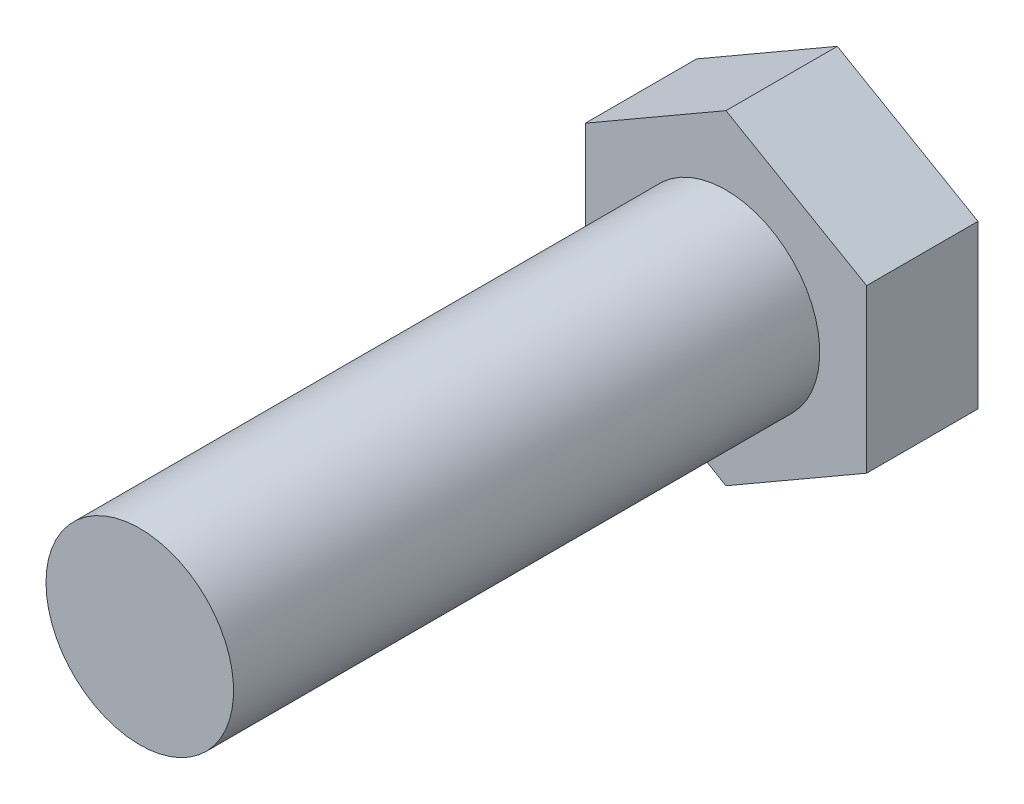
ISO-10303-21;
HEADER;
FILE_DESCRIPTION(('STEP AP214'),'2;1');
FILE_NAME('part.step','',(''),(''),'','','');
FILE_SCHEMA(('AUTOMOTIVE_DESIGN { 1 0 10303 214 1 1 1 1 }'));
ENDSEC;
DATA;
#1=APPLICATION_CONTEXT('core data for automotive mechanical design processes');
#2=APPLICATION_PROTOCOL_DEFINITION('international standard','automotive_design',2000,#1);
#3=PRODUCT_CONTEXT('',#1,'mechanical');
#4=PRODUCT('Part','Part','',(#3));
#5=PRODUCT_RELATED_PRODUCT_CATEGORY('part','',(#4));
#6=PRODUCT_DEFINITION_FORMATION('','',#4);
#7=PRODUCT_DEFINITION_CONTEXT('part definition',#1,'design');
#8=PRODUCT_DEFINITION('design','',#6,#7);
#9=PRODUCT_DEFINITION_SHAPE('','',#8);
#10=(LENGTH_UNIT() NAMED_UNIT(*) SI_UNIT(.MILLI.,.METRE.));
#11=(NAMED_UNIT(*) PLANE_ANGLE_UNIT() SI_UNIT($,.RADIAN.));
#12=(NAMED_UNIT(*) SI_UNIT($,.STERADIAN.) SOLID_ANGLE_UNIT());
#13=UNCERTAINTY_MEASURE_WITH_UNIT(LENGTH_MEASURE(1.E-05),#10,'distance_accuracy_value','');
#14=(GEOMETRIC_REPRESENTATION_CONTEXT(3) GLOBAL_UNCERTAINTY_ASSIGNED_CONTEXT((#13)) GLOBAL_UNIT_ASSIGNED_CONTEXT((#10,
#11,#12)) REPRESENTATION_CONTEXT('',''));
#15=CARTESIAN_POINT('',(0.,0.,0.));
#16=DIRECTION('',(0.,0.,1.));
#17=DIRECTION('',(1.,0.,0.));
#18=AXIS2_PLACEMENT_3D('',#15,#16,#17);
#19=CARTESIAN_POINT('',(0.,0.,61.));
#20=DIRECTION('',(0.,0.,-1.));
#21=DIRECTION('',(-1.,0.,0.));
#22=AXIS2_PLACEMENT_3D('',#19,#20,#21);
#23=PLANE('',#22);
#24=CARTESIAN_POINT('',(0.,0.,61.));
#25=DIRECTION('',(0.,0.,-1.));
#26=DIRECTION('',(-1.,0.,0.));
#27=AXIS2_PLACEMENT_3D('',#24,#25,#26);
#28=CIRCLE('',#27,8.);
#29=CARTESIAN_POINT('',(-8.,0.,61.));
#30=VERTEX_POINT('',#29);
#31=EDGE_CURVE('E22',#30,#30,#28,.T.);
#32=ORIENTED_EDGE('',*,*,#31,.F.);
#33=EDGE_LOOP('',(#32));
#34=FACE_BOUND('',#33,.T.);
#35=ADVANCED_FACE('F15',(#34),#23,.F.);
#36=CARTESIAN_POINT('',(0.,0.,-9.));
#37=DIRECTION('',(0.,0.,-1.));
#38=DIRECTION('',(-1.,0.,0.));
#39=AXIS2_PLACEMENT_3D('',#36,#37,#38);
#40=CYLINDRICAL_SURFACE('',#39,8.);
#41=CARTESIAN_POINT('',(0.,0.,11.));
#42=DIRECTION('',(0.,0.,-1.));
#43=DIRECTION('',(-1.,0.,0.));
#44=AXIS2_PLACEMENT_3D('',#41,#42,#43);
#45=CIRCLE('',#44,8.);
#46=CARTESIAN_POINT('',(-8.,0.,11.));
#47=VERTEX_POINT('',#46);
#48=EDGE_CURVE('E110',#47,#47,#45,.T.);
#49=ORIENTED_EDGE('',*,*,#48,.F.);
#50=EDGE_LOOP('',(#49));
#51=FACE_BOUND('',#50,.T.);
#52=ORIENTED_EDGE('',*,*,#31,.T.);
#53=EDGE_LOOP('',(#52));
#54=FACE_BOUND('',#53,.T.);
#55=ADVANCED_FACE('F154',(#51,#54),#40,.T.);
#56=CARTESIAN_POINT('',(-8.,0.,11.));
#57=DIRECTION('',(0.,0.,-1.));
#58=DIRECTION('',(-1.,0.,0.));
#59=AXIS2_PLACEMENT_3D('',#56,#57,#58);
#60=PLANE('',#59);
#61=DIRECTION('',(0.866025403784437,-0.5,0.));
#62=VECTOR('',#61,1.);
#63=CARTESIAN_POINT('',(0.,13.856406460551,11.));
#64=LINE('',#63,#62);
#65=CARTESIAN_POINT('',(0.,13.8564064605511,11.));
#66=VERTEX_POINT('',#65);
#67=CARTESIAN_POINT('',(12.,6.92820323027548,11.));
#68=VERTEX_POINT('',#67);
#69=EDGE_CURVE('E81',#66,#68,#64,.T.);
#70=ORIENTED_EDGE('',*,*,#69,.F.);
#71=DIRECTION('',(-0.866025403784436,-0.5,0.));
#72=VECTOR('',#71,1.);
#73=CARTESIAN_POINT('',(-12.,6.92820323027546,11.));
#74=LINE('',#73,#72);
#75=CARTESIAN_POINT('',(-12.,6.92820323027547,11.));
#76=VERTEX_POINT('',#75);
#77=EDGE_CURVE('E107',#66,#76,#74,.T.);
#78=ORIENTED_EDGE('',*,*,#77,.T.);
#79=DIRECTION('',(0.,-1.,0.));
#80=VECTOR('',#79,1.);
#81=CARTESIAN_POINT('',(-12.,0.,11.));
#82=LINE('',#81,#80);
#83=CARTESIAN_POINT('',(-12.,-6.92820323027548,11.));
#84=VERTEX_POINT('',#83);
#85=EDGE_CURVE('E104',#76,#84,#82,.T.);
#86=ORIENTED_EDGE('',*,*,#85,.T.);
#87=DIRECTION('',(-0.866025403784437,0.5,0.));
#88=VECTOR('',#87,1.);
#89=CARTESIAN_POINT('',(-12.,-6.92820323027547,11.));
#90=LINE('',#89,#88);
#91=CARTESIAN_POINT('',(0.,-13.8564064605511,11.));
#92=VERTEX_POINT('',#91);
#93=EDGE_CURVE('E102',#92,#84,#90,.T.);
#94=ORIENTED_EDGE('',*,*,#93,.F.);
#95=DIRECTION('',(0.866025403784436,0.5,0.));
#96=VECTOR('',#95,1.);
#97=CARTESIAN_POINT('',(0.,-13.856406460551,11.));
#98=LINE('',#97,#96);
#99=CARTESIAN_POINT('',(12.,-6.92820323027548,11.));
#100=VERTEX_POINT('',#99);
#101=EDGE_CURVE('E99',#92,#100,#98,.T.);
#102=ORIENTED_EDGE('',*,*,#101,.T.);
#103=DIRECTION('',(0.,-1.,0.));
#104=VECTOR('',#103,1.);
#105=CARTESIAN_POINT('',(12.,0.,11.));
#106=LINE('',#105,#104);
#107=EDGE_CURVE('E97',#68,#100,#106,.T.);
#108=ORIENTED_EDGE('',*,*,#107,.F.);
#109=EDGE_LOOP('',(#70,#78,#86,#94,#102,#108));
#110=FACE_BOUND('',#109,.T.);
#111=ORIENTED_EDGE('',*,*,#48,.T.);
#112=EDGE_LOOP('',(#111));
#113=FACE_BOUND('',#112,.T.);
#114=ADVANCED_FACE('F136',(#110,#113),#60,.F.);
#115=CARTESIAN_POINT('',(0.,13.8564064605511,12.));
#116=DIRECTION('',(0.5,-0.866025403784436,0.));
#117=DIRECTION('',(-0.866025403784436,-0.5,0.));
#118=AXIS2_PLACEMENT_3D('',#115,#116,#117);
#119=PLANE('',#118);
#120=DIRECTION('',(0.,0.,-1.));
#121=VECTOR('',#120,1.);
#122=CARTESIAN_POINT('',(0.,13.8564064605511,12.));
#123=LINE('',#122,#121);
#124=CARTESIAN_POINT('',(0.,13.8564064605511,1.5));
#125=VERTEX_POINT('',#124);
#126=EDGE_CURVE('E35',#66,#125,#123,.T.);
#127=ORIENTED_EDGE('',*,*,#126,.T.);
#128=DIRECTION('',(-0.866025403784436,-0.5,0.));
#129=VECTOR('',#128,1.);
#130=CARTESIAN_POINT('',(0.,13.8564064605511,1.5));
#131=LINE('',#130,#129);
#132=CARTESIAN_POINT('',(-12.,6.92820323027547,1.5));
#133=VERTEX_POINT('',#132);
#134=EDGE_CURVE('E28',#125,#133,#131,.T.);
#135=ORIENTED_EDGE('',*,*,#134,.T.);
#136=DIRECTION('',(0.,0.,-1.));
#137=VECTOR('',#136,1.);
#138=CARTESIAN_POINT('',(-12.,6.92820323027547,12.));
#139=LINE('',#138,#137);
#140=EDGE_CURVE('E93',#76,#133,#139,.T.);
#141=ORIENTED_EDGE('',*,*,#140,.F.);
#142=ORIENTED_EDGE('',*,*,#77,.F.);
#143=EDGE_LOOP('',(#127,#135,#141,#142));
#144=FACE_BOUND('',#143,.T.);
#145=ADVANCED_FACE('F130',(#144),#119,.F.);
#146=CARTESIAN_POINT('',(-12.,6.92820323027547,12.));
#147=DIRECTION('',(1.,0.,0.));
#148=DIRECTION('',(0.,0.,-1.));
#149=AXIS2_PLACEMENT_3D('',#146,#147,#148);
#150=PLANE('',#149);
#151=ORIENTED_EDGE('',*,*,#140,.T.);
#152=DIRECTION('',(0.,-1.,0.));
#153=VECTOR('',#152,1.);
#154=CARTESIAN_POINT('',(-12.,6.92820323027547,1.5));
#155=LINE('',#154,#153);
#156=CARTESIAN_POINT('',(-12.,-6.92820323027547,1.5));
#157=VERTEX_POINT('',#156);
#158=EDGE_CURVE('E126',#133,#157,#155,.T.);
#159=ORIENTED_EDGE('',*,*,#158,.T.);
#160=DIRECTION('',(0.,0.,-1.));
#161=VECTOR('',#160,1.);
#162=CARTESIAN_POINT('',(-12.,-6.92820323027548,12.));
#163=LINE('',#162,#161);
#164=EDGE_CURVE('E90',#84,#157,#163,.T.);
#165=ORIENTED_EDGE('',*,*,#164,.F.);
#166=ORIENTED_EDGE('',*,*,#85,.F.);
#167=EDGE_LOOP('',(#151,#159,#165,#166));
#168=FACE_BOUND('',#167,.T.);
#169=ADVANCED_FACE('F132',(#168),#150,.F.);
#170=CARTESIAN_POINT('',(0.,-13.8564064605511,12.));
#171=DIRECTION('',(-0.5,-0.866025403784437,0.));
#172=DIRECTION('',(-0.866025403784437,0.5,0.));
#173=AXIS2_PLACEMENT_3D('',#170,#171,#172);
#174=PLANE('',#173);
#175=DIRECTION('',(-0.866025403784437,0.5,0.));
#176=VECTOR('',#175,1.);
#177=CARTESIAN_POINT('',(0.,-13.8564064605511,1.5));
#178=LINE('',#177,#176);
#179=CARTESIAN_POINT('',(0.,-13.8564064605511,1.5));
#180=VERTEX_POINT('',#179);
#181=EDGE_CURVE('E124',#180,#157,#178,.T.);
#182=ORIENTED_EDGE('',*,*,#181,.F.);
#183=DIRECTION('',(0.,0.,-1.));
#184=VECTOR('',#183,1.);
#185=CARTESIAN_POINT('',(0.,-13.8564064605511,12.));
#186=LINE('',#185,#184);
#187=EDGE_CURVE('E83',#92,#180,#186,.T.);
#188=ORIENTED_EDGE('',*,*,#187,.F.);
#189=ORIENTED_EDGE('',*,*,#93,.T.);
#190=ORIENTED_EDGE('',*,*,#164,.T.);
#191=EDGE_LOOP('',(#182,#188,#189,#190));
#192=FACE_BOUND('',#191,.T.);
#193=ADVANCED_FACE('F143',(#192),#174,.T.);
#194=CARTESIAN_POINT('',(0.,-13.8564064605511,12.));
#195=DIRECTION('',(-0.5,0.866025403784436,0.));
#196=DIRECTION('',(0.866025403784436,0.5,0.));
#197=AXIS2_PLACEMENT_3D('',#194,#195,#196);
#198=PLANE('',#197);
#199=ORIENTED_EDGE('',*,*,#187,.T.);
#200=DIRECTION('',(0.866025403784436,0.5,0.));
#201=VECTOR('',#200,1.);
#202=CARTESIAN_POINT('',(0.,-13.8564064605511,1.5));
#203=LINE('',#202,#201);
#204=CARTESIAN_POINT('',(12.,-6.92820323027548,1.5));
#205=VERTEX_POINT('',#204);
#206=EDGE_CURVE('E76',#180,#205,#203,.T.);
#207=ORIENTED_EDGE('',*,*,#206,.T.);
#208=DIRECTION('',(0.,0.,-1.));
#209=VECTOR('',#208,1.);
#210=CARTESIAN_POINT('',(12.,-6.92820323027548,12.));
#211=LINE('',#210,#209);
#212=EDGE_CURVE('E75',#100,#205,#211,.T.);
#213=ORIENTED_EDGE('',*,*,#212,.F.);
#214=ORIENTED_EDGE('',*,*,#101,.F.);
#215=EDGE_LOOP('',(#199,#207,#213,#214));
#216=FACE_BOUND('',#215,.T.);
#217=ADVANCED_FACE('F139',(#216),#198,.F.);
#218=CARTESIAN_POINT('',(12.,6.92820323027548,12.));
#219=DIRECTION('',(1.,0.,0.));
#220=DIRECTION('',(0.,0.,-1.));
#221=AXIS2_PLACEMENT_3D('',#218,#219,#220);
#222=PLANE('',#221);
#223=DIRECTION('',(0.,-1.,0.));
#224=VECTOR('',#223,1.);
#225=CARTESIAN_POINT('',(12.,6.92820323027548,1.5));
#226=LINE('',#225,#224);
#227=CARTESIAN_POINT('',(12.,6.92820323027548,1.5));
#228=VERTEX_POINT('',#227);
#229=EDGE_CURVE('E65',#228,#205,#226,.T.);
#230=ORIENTED_EDGE('',*,*,#229,.F.);
#231=DIRECTION('',(0.,0.,-1.));
#232=VECTOR('',#231,1.);
#233=CARTESIAN_POINT('',(12.,6.92820323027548,12.));
#234=LINE('',#233,#232);
#235=EDGE_CURVE('E72',#68,#228,#234,.T.);
#236=ORIENTED_EDGE('',*,*,#235,.F.);
#237=ORIENTED_EDGE('',*,*,#107,.T.);
#238=ORIENTED_EDGE('',*,*,#212,.T.);
#239=EDGE_LOOP('',(#230,#236,#237,#238));
#240=FACE_BOUND('',#239,.T.);
#241=ADVANCED_FACE('F71',(#240),#222,.T.);
#242=CARTESIAN_POINT('',(0.,13.8564064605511,12.));
#243=DIRECTION('',(0.5,0.866025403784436,0.));
#244=DIRECTION('',(0.866025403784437,-0.5,0.));
#245=AXIS2_PLACEMENT_3D('',#242,#243,#244);
#246=PLANE('',#245);
#247=DIRECTION('',(0.866025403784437,-0.5,0.));
#248=VECTOR('',#247,1.);
#249=CARTESIAN_POINT('',(0.,13.8564064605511,1.5));
#250=LINE('',#249,#248);
#251=EDGE_CURVE('E9',#125,#228,#250,.T.);
#252=ORIENTED_EDGE('',*,*,#251,.F.);
#253=ORIENTED_EDGE('',*,*,#126,.F.);
#254=ORIENTED_EDGE('',*,*,#69,.T.);
#255=ORIENTED_EDGE('',*,*,#235,.T.);
#256=EDGE_LOOP('',(#252,#253,#254,#255));
#257=FACE_BOUND('',#256,.T.);
#258=ADVANCED_FACE('F79',(#257),#246,.T.);
#259=CARTESIAN_POINT('',(0.,16.05,1.5));
#260=DIRECTION('',(0.,0.,1.));
#261=DIRECTION('',(1.,0.,0.));
#262=AXIS2_PLACEMENT_3D('',#259,#260,#261);
#263=PLANE('',#262);
#264=CARTESIAN_POINT('',(0.,0.,1.5));
#265=DIRECTION('',(0.,0.,-1.));
#266=DIRECTION('',(-1.,0.,0.));
#267=AXIS2_PLACEMENT_3D('',#264,#265,#266);
#268=CIRCLE('',#267,9.5);
#269=CARTESIAN_POINT('',(-9.5,0.,1.5));
#270=VERTEX_POINT('',#269);
#271=EDGE_CURVE('E115',#270,#270,#268,.T.);
#272=ORIENTED_EDGE('',*,*,#271,.F.);
#273=EDGE_LOOP('',(#272));
#274=FACE_BOUND('',#273,.T.);
#275=ORIENTED_EDGE('',*,*,#251,.T.);
#276=ORIENTED_EDGE('',*,*,#229,.T.);
#277=ORIENTED_EDGE('',*,*,#206,.F.);
#278=ORIENTED_EDGE('',*,*,#181,.T.);
#279=ORIENTED_EDGE('',*,*,#158,.F.);
#280=ORIENTED_EDGE('',*,*,#134,.F.);
#281=EDGE_LOOP('',(#275,#276,#277,#278,#279,#280));
#282=FACE_BOUND('',#281,.T.);
#283=ADVANCED_FACE('F64',(#274,#282),#263,.F.);
#284=CARTESIAN_POINT('',(0.,0.,21.));
#285=DIRECTION('',(0.,0.,-1.));
#286=DIRECTION('',(-1.,0.,0.));
#287=AXIS2_PLACEMENT_3D('',#284,#285,#286);
#288=CYLINDRICAL_SURFACE('',#287,9.5);
#289=ORIENTED_EDGE('',*,*,#271,.T.);
#290=EDGE_LOOP('',(#289));
#291=FACE_BOUND('',#290,.T.);
#292=CARTESIAN_POINT('',(0.,0.,0.));
#293=DIRECTION('',(0.,0.,1.));
#294=DIRECTION('',(1.,0.,0.));
#295=AXIS2_PLACEMENT_3D('',#292,#293,#294);
#296=CIRCLE('',#295,9.5);
#297=CARTESIAN_POINT('',(9.5,0.,0.));
#298=VERTEX_POINT('',#297);
#299=EDGE_CURVE('E77',#298,#298,#296,.T.);
#300=ORIENTED_EDGE('',*,*,#299,.T.);
#301=EDGE_LOOP('',(#300));
#302=FACE_BOUND('',#301,.T.);
#303=ADVANCED_FACE('F170',(#291,#302),#288,.T.);
#304=CARTESIAN_POINT('',(-14.,0.,0.));
#305=DIRECTION('',(0.,0.,1.));
#306=DIRECTION('',(1.,0.,0.));
#307=AXIS2_PLACEMENT_3D('',#304,#305,#306);
#308=PLANE('',#307);
#309=ORIENTED_EDGE('',*,*,#299,.F.);
#310=EDGE_LOOP('',(#309));
#311=FACE_BOUND('',#310,.T.);
#312=ADVANCED_FACE('F168',(#311),#308,.F.);
#313=CLOSED_SHELL('',(#35,#55,#114,#145,#169,#193,#217,#241,#258,#283,#303,#312));
#314=MANIFOLD_SOLID_BREP('B1',#313);
#315=ADVANCED_BREP_SHAPE_REPRESENTATION('',(#18,#314),#14);
#316=SHAPE_DEFINITION_REPRESENTATION(#9,#315);
ENDSEC;
END-ISO-10303-21;
